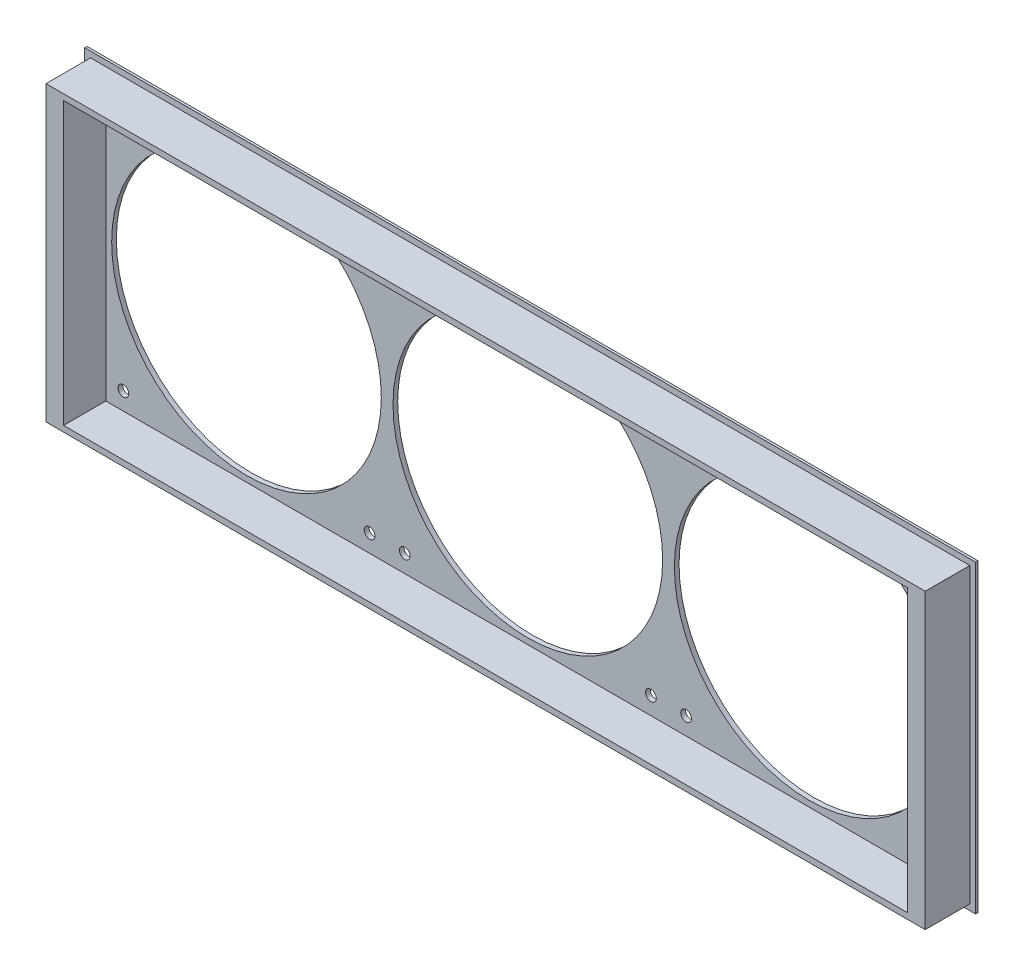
ISO-10303-21;
HEADER;
FILE_DESCRIPTION(('STEP AP214'),'2;1');
FILE_NAME('part.step','',(''),(''),'','','');
FILE_SCHEMA(('AUTOMOTIVE_DESIGN { 1 0 10303 214 1 1 1 1 }'));
ENDSEC;
DATA;
#1=APPLICATION_CONTEXT('core data for automotive mechanical design processes');
#2=APPLICATION_PROTOCOL_DEFINITION('international standard','automotive_design',2000,#1);
#3=PRODUCT_CONTEXT('',#1,'mechanical');
#4=PRODUCT('Part','Part','',(#3));
#5=PRODUCT_RELATED_PRODUCT_CATEGORY('part','',(#4));
#6=PRODUCT_DEFINITION_FORMATION('','',#4);
#7=PRODUCT_DEFINITION_CONTEXT('part definition',#1,'design');
#8=PRODUCT_DEFINITION('design','',#6,#7);
#9=PRODUCT_DEFINITION_SHAPE('','',#8);
#10=(LENGTH_UNIT() NAMED_UNIT(*) SI_UNIT(.MILLI.,.METRE.));
#11=(NAMED_UNIT(*) PLANE_ANGLE_UNIT() SI_UNIT($,.RADIAN.));
#12=(NAMED_UNIT(*) SI_UNIT($,.STERADIAN.) SOLID_ANGLE_UNIT());
#13=UNCERTAINTY_MEASURE_WITH_UNIT(LENGTH_MEASURE(1.E-05),#10,'distance_accuracy_value','');
#14=(GEOMETRIC_REPRESENTATION_CONTEXT(3) GLOBAL_UNCERTAINTY_ASSIGNED_CONTEXT((#13)) GLOBAL_UNIT_ASSIGNED_CONTEXT((#10,
#11,#12)) REPRESENTATION_CONTEXT('',''));
#15=CARTESIAN_POINT('',(0.,0.,0.));
#16=DIRECTION('',(0.,0.,1.));
#17=DIRECTION('',(1.,0.,0.));
#18=AXIS2_PLACEMENT_3D('',#15,#16,#17);
#19=CARTESIAN_POINT('',(-131.094890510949,20.2919708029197,-10.));
#20=DIRECTION('',(0.,0.,1.));
#21=DIRECTION('',(1.,0.,0.));
#22=AXIS2_PLACEMENT_3D('',#19,#20,#21);
#23=CYLINDRICAL_SURFACE('',#22,57.5);
#24=CARTESIAN_POINT('',(-131.094890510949,20.2919708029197,0.));
#25=DIRECTION('',(0.,0.,1.));
#26=DIRECTION('',(1.,0.,0.));
#27=AXIS2_PLACEMENT_3D('',#24,#25,#26);
#28=CIRCLE('',#27,57.5);
#29=CARTESIAN_POINT('',(-73.5948905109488,20.2919708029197,0.));
#30=VERTEX_POINT('',#29);
#31=EDGE_CURVE('E231',#30,#30,#28,.T.);
#32=ORIENTED_EDGE('',*,*,#31,.F.);
#33=EDGE_LOOP('',(#32));
#34=FACE_BOUND('',#33,.T.);
#35=CARTESIAN_POINT('',(-131.094890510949,20.2919708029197,2.));
#36=DIRECTION('',(0.,0.,1.));
#37=DIRECTION('',(1.,0.,0.));
#38=AXIS2_PLACEMENT_3D('',#35,#36,#37);
#39=CIRCLE('',#38,57.5);
#40=CARTESIAN_POINT('',(-73.5948905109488,20.2919708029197,2.));
#41=VERTEX_POINT('',#40);
#42=EDGE_CURVE('E186',#41,#41,#39,.F.);
#43=ORIENTED_EDGE('',*,*,#42,.F.);
#44=EDGE_LOOP('',(#43));
#45=FACE_BOUND('',#44,.T.);
#46=ADVANCED_FACE('F32',(#34,#45),#23,.F.);
#47=CARTESIAN_POINT('',(108.905109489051,20.2919708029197,-10.));
#48=DIRECTION('',(0.,0.,1.));
#49=DIRECTION('',(1.,0.,0.));
#50=AXIS2_PLACEMENT_3D('',#47,#48,#49);
#51=CYLINDRICAL_SURFACE('',#50,57.5);
#52=CARTESIAN_POINT('',(108.905109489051,20.2919708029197,0.));
#53=DIRECTION('',(0.,0.,1.));
#54=DIRECTION('',(1.,0.,0.));
#55=AXIS2_PLACEMENT_3D('',#52,#53,#54);
#56=CIRCLE('',#55,57.5);
#57=CARTESIAN_POINT('',(166.405109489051,20.2919708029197,0.));
#58=VERTEX_POINT('',#57);
#59=EDGE_CURVE('E225',#58,#58,#56,.T.);
#60=ORIENTED_EDGE('',*,*,#59,.F.);
#61=EDGE_LOOP('',(#60));
#62=FACE_BOUND('',#61,.T.);
#63=CARTESIAN_POINT('',(108.905109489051,20.2919708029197,2.));
#64=DIRECTION('',(0.,0.,1.));
#65=DIRECTION('',(1.,0.,0.));
#66=AXIS2_PLACEMENT_3D('',#63,#64,#65);
#67=CIRCLE('',#66,57.5);
#68=CARTESIAN_POINT('',(166.405109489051,20.2919708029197,2.));
#69=VERTEX_POINT('',#68);
#70=EDGE_CURVE('E183',#69,#69,#67,.F.);
#71=ORIENTED_EDGE('',*,*,#70,.F.);
#72=EDGE_LOOP('',(#71));
#73=FACE_BOUND('',#72,.T.);
#74=ADVANCED_FACE('F331',(#62,#73),#51,.F.);
#75=CARTESIAN_POINT('',(-11.0948905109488,20.2919708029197,-10.));
#76=DIRECTION('',(0.,0.,1.));
#77=DIRECTION('',(1.,0.,0.));
#78=AXIS2_PLACEMENT_3D('',#75,#76,#77);
#79=CYLINDRICAL_SURFACE('',#78,57.5);
#80=CARTESIAN_POINT('',(-11.0948905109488,20.2919708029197,0.));
#81=DIRECTION('',(0.,0.,1.));
#82=DIRECTION('',(1.,0.,0.));
#83=AXIS2_PLACEMENT_3D('',#80,#81,#82);
#84=CIRCLE('',#83,57.5);
#85=CARTESIAN_POINT('',(46.4051094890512,20.2919708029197,0.));
#86=VERTEX_POINT('',#85);
#87=EDGE_CURVE('E228',#86,#86,#84,.T.);
#88=ORIENTED_EDGE('',*,*,#87,.F.);
#89=EDGE_LOOP('',(#88));
#90=FACE_BOUND('',#89,.T.);
#91=CARTESIAN_POINT('',(-11.0948905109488,20.2919708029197,2.));
#92=DIRECTION('',(0.,0.,1.));
#93=DIRECTION('',(1.,0.,0.));
#94=AXIS2_PLACEMENT_3D('',#91,#92,#93);
#95=CIRCLE('',#94,57.5);
#96=CARTESIAN_POINT('',(46.4051094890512,20.2919708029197,2.));
#97=VERTEX_POINT('',#96);
#98=EDGE_CURVE('E180',#97,#97,#95,.F.);
#99=ORIENTED_EDGE('',*,*,#98,.F.);
#100=EDGE_LOOP('',(#99));
#101=FACE_BOUND('',#100,.T.);
#102=ADVANCED_FACE('F337',(#90,#101),#79,.F.);
#103=CARTESIAN_POINT('',(-183.59489051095,72.7919708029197,-10.));
#104=DIRECTION('',(0.,0.,1.));
#105=DIRECTION('',(1.,0.,0.));
#106=AXIS2_PLACEMENT_3D('',#103,#104,#105);
#107=CYLINDRICAL_SURFACE('',#106,2.285);
#108=CARTESIAN_POINT('',(-183.59489051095,72.7919708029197,0.));
#109=DIRECTION('',(0.,0.,1.));
#110=DIRECTION('',(1.,0.,0.));
#111=AXIS2_PLACEMENT_3D('',#108,#109,#110);
#112=CIRCLE('',#111,2.285);
#113=CARTESIAN_POINT('',(-181.30989051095,72.7919708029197,0.));
#114=VERTEX_POINT('',#113);
#115=EDGE_CURVE('E222',#114,#114,#112,.T.);
#116=ORIENTED_EDGE('',*,*,#115,.F.);
#117=EDGE_LOOP('',(#116));
#118=FACE_BOUND('',#117,.T.);
#119=CARTESIAN_POINT('',(-183.59489051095,72.7919708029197,2.));
#120=DIRECTION('',(0.,0.,1.));
#121=DIRECTION('',(1.,0.,0.));
#122=AXIS2_PLACEMENT_3D('',#119,#120,#121);
#123=CIRCLE('',#122,2.285);
#124=CARTESIAN_POINT('',(-181.30989051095,72.7919708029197,2.));
#125=VERTEX_POINT('',#124);
#126=EDGE_CURVE('E177',#125,#125,#123,.F.);
#127=ORIENTED_EDGE('',*,*,#126,.F.);
#128=EDGE_LOOP('',(#127));
#129=FACE_BOUND('',#128,.T.);
#130=ADVANCED_FACE('F473',(#118,#129),#107,.F.);
#131=CARTESIAN_POINT('',(41.4051094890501,72.7919708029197,-10.));
#132=DIRECTION('',(0.,0.,1.));
#133=DIRECTION('',(1.,0.,0.));
#134=AXIS2_PLACEMENT_3D('',#131,#132,#133);
#135=CYLINDRICAL_SURFACE('',#134,2.285);
#136=CARTESIAN_POINT('',(41.4051094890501,72.7919708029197,0.));
#137=DIRECTION('',(0.,0.,1.));
#138=DIRECTION('',(1.,0.,0.));
#139=AXIS2_PLACEMENT_3D('',#136,#137,#138);
#140=CIRCLE('',#139,2.285);
#141=CARTESIAN_POINT('',(43.6901094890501,72.7919708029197,0.));
#142=VERTEX_POINT('',#141);
#143=EDGE_CURVE('E189',#142,#142,#140,.T.);
#144=ORIENTED_EDGE('',*,*,#143,.F.);
#145=EDGE_LOOP('',(#144));
#146=FACE_BOUND('',#145,.T.);
#147=CARTESIAN_POINT('',(41.4051094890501,72.7919708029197,2.));
#148=DIRECTION('',(0.,0.,1.));
#149=DIRECTION('',(1.,0.,0.));
#150=AXIS2_PLACEMENT_3D('',#147,#148,#149);
#151=CIRCLE('',#150,2.285);
#152=CARTESIAN_POINT('',(43.6901094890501,72.7919708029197,2.));
#153=VERTEX_POINT('',#152);
#154=EDGE_CURVE('E174',#153,#153,#151,.F.);
#155=ORIENTED_EDGE('',*,*,#154,.F.);
#156=EDGE_LOOP('',(#155));
#157=FACE_BOUND('',#156,.T.);
#158=ADVANCED_FACE('F481',(#146,#157),#135,.F.);
#159=CARTESIAN_POINT('',(-63.5948905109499,72.7919708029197,-10.));
#160=DIRECTION('',(0.,0.,1.));
#161=DIRECTION('',(1.,0.,0.));
#162=AXIS2_PLACEMENT_3D('',#159,#160,#161);
#163=CYLINDRICAL_SURFACE('',#162,2.285);
#164=CARTESIAN_POINT('',(-63.5948905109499,72.7919708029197,0.));
#165=DIRECTION('',(0.,0.,1.));
#166=DIRECTION('',(1.,0.,0.));
#167=AXIS2_PLACEMENT_3D('',#164,#165,#166);
#168=CIRCLE('',#167,2.285);
#169=CARTESIAN_POINT('',(-61.3098905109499,72.7919708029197,0.));
#170=VERTEX_POINT('',#169);
#171=EDGE_CURVE('E192',#170,#170,#168,.T.);
#172=ORIENTED_EDGE('',*,*,#171,.F.);
#173=EDGE_LOOP('',(#172));
#174=FACE_BOUND('',#173,.T.);
#175=CARTESIAN_POINT('',(-63.5948905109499,72.7919708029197,2.));
#176=DIRECTION('',(0.,0.,1.));
#177=DIRECTION('',(1.,0.,0.));
#178=AXIS2_PLACEMENT_3D('',#175,#176,#177);
#179=CIRCLE('',#178,2.285);
#180=CARTESIAN_POINT('',(-61.3098905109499,72.7919708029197,2.));
#181=VERTEX_POINT('',#180);
#182=EDGE_CURVE('E171',#181,#181,#179,.F.);
#183=ORIENTED_EDGE('',*,*,#182,.F.);
#184=EDGE_LOOP('',(#183));
#185=FACE_BOUND('',#184,.T.);
#186=ADVANCED_FACE('F490',(#174,#185),#163,.F.);
#187=CARTESIAN_POINT('',(-183.594890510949,-32.2080291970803,-10.));
#188=DIRECTION('',(0.,0.,1.));
#189=DIRECTION('',(1.,0.,0.));
#190=AXIS2_PLACEMENT_3D('',#187,#188,#189);
#191=CYLINDRICAL_SURFACE('',#190,2.285);
#192=CARTESIAN_POINT('',(-183.594890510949,-32.2080291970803,0.));
#193=DIRECTION('',(0.,0.,1.));
#194=DIRECTION('',(1.,0.,0.));
#195=AXIS2_PLACEMENT_3D('',#192,#193,#194);
#196=CIRCLE('',#195,2.285);
#197=CARTESIAN_POINT('',(-181.309890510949,-32.2080291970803,0.));
#198=VERTEX_POINT('',#197);
#199=EDGE_CURVE('E195',#198,#198,#196,.T.);
#200=ORIENTED_EDGE('',*,*,#199,.F.);
#201=EDGE_LOOP('',(#200));
#202=FACE_BOUND('',#201,.T.);
#203=CARTESIAN_POINT('',(-183.594890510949,-32.2080291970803,2.));
#204=DIRECTION('',(0.,0.,1.));
#205=DIRECTION('',(1.,0.,0.));
#206=AXIS2_PLACEMENT_3D('',#203,#204,#205);
#207=CIRCLE('',#206,2.285);
#208=CARTESIAN_POINT('',(-181.309890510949,-32.2080291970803,2.));
#209=VERTEX_POINT('',#208);
#210=EDGE_CURVE('E168',#209,#209,#207,.F.);
#211=ORIENTED_EDGE('',*,*,#210,.F.);
#212=EDGE_LOOP('',(#211));
#213=FACE_BOUND('',#212,.T.);
#214=ADVANCED_FACE('F499',(#202,#213),#191,.F.);
#215=CARTESIAN_POINT('',(-78.5948905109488,-32.2080291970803,-10.));
#216=DIRECTION('',(0.,0.,1.));
#217=DIRECTION('',(1.,0.,0.));
#218=AXIS2_PLACEMENT_3D('',#215,#216,#217);
#219=CYLINDRICAL_SURFACE('',#218,2.285);
#220=CARTESIAN_POINT('',(-78.5948905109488,-32.2080291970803,0.));
#221=DIRECTION('',(0.,0.,1.));
#222=DIRECTION('',(1.,0.,0.));
#223=AXIS2_PLACEMENT_3D('',#220,#221,#222);
#224=CIRCLE('',#223,2.285);
#225=CARTESIAN_POINT('',(-76.3098905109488,-32.2080291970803,0.));
#226=VERTEX_POINT('',#225);
#227=EDGE_CURVE('E198',#226,#226,#224,.T.);
#228=ORIENTED_EDGE('',*,*,#227,.F.);
#229=EDGE_LOOP('',(#228));
#230=FACE_BOUND('',#229,.T.);
#231=CARTESIAN_POINT('',(-78.5948905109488,-32.2080291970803,2.));
#232=DIRECTION('',(0.,0.,1.));
#233=DIRECTION('',(1.,0.,0.));
#234=AXIS2_PLACEMENT_3D('',#231,#232,#233);
#235=CIRCLE('',#234,2.285);
#236=CARTESIAN_POINT('',(-76.3098905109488,-32.2080291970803,2.));
#237=VERTEX_POINT('',#236);
#238=EDGE_CURVE('E165',#237,#237,#235,.F.);
#239=ORIENTED_EDGE('',*,*,#238,.F.);
#240=EDGE_LOOP('',(#239));
#241=FACE_BOUND('',#240,.T.);
#242=ADVANCED_FACE('F508',(#230,#241),#219,.F.);
#243=CARTESIAN_POINT('',(-78.5948905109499,72.7919708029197,-10.));
#244=DIRECTION('',(0.,0.,1.));
#245=DIRECTION('',(1.,0.,0.));
#246=AXIS2_PLACEMENT_3D('',#243,#244,#245);
#247=CYLINDRICAL_SURFACE('',#246,2.285);
#248=CARTESIAN_POINT('',(-78.5948905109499,72.7919708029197,0.));
#249=DIRECTION('',(0.,0.,1.));
#250=DIRECTION('',(1.,0.,0.));
#251=AXIS2_PLACEMENT_3D('',#248,#249,#250);
#252=CIRCLE('',#251,2.285);
#253=CARTESIAN_POINT('',(-76.3098905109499,72.7919708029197,0.));
#254=VERTEX_POINT('',#253);
#255=EDGE_CURVE('E201',#254,#254,#252,.T.);
#256=ORIENTED_EDGE('',*,*,#255,.F.);
#257=EDGE_LOOP('',(#256));
#258=FACE_BOUND('',#257,.T.);
#259=CARTESIAN_POINT('',(-78.5948905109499,72.7919708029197,2.));
#260=DIRECTION('',(0.,0.,1.));
#261=DIRECTION('',(1.,0.,0.));
#262=AXIS2_PLACEMENT_3D('',#259,#260,#261);
#263=CIRCLE('',#262,2.285);
#264=CARTESIAN_POINT('',(-76.3098905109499,72.7919708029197,2.));
#265=VERTEX_POINT('',#264);
#266=EDGE_CURVE('E162',#265,#265,#263,.F.);
#267=ORIENTED_EDGE('',*,*,#266,.F.);
#268=EDGE_LOOP('',(#267));
#269=FACE_BOUND('',#268,.T.);
#270=ADVANCED_FACE('F517',(#258,#269),#247,.F.);
#271=CARTESIAN_POINT('',(56.4051094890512,-32.2080291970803,-10.));
#272=DIRECTION('',(0.,0.,1.));
#273=DIRECTION('',(1.,0.,0.));
#274=AXIS2_PLACEMENT_3D('',#271,#272,#273);
#275=CYLINDRICAL_SURFACE('',#274,2.285);
#276=CARTESIAN_POINT('',(56.4051094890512,-32.2080291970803,0.));
#277=DIRECTION('',(0.,0.,1.));
#278=DIRECTION('',(1.,0.,0.));
#279=AXIS2_PLACEMENT_3D('',#276,#277,#278);
#280=CIRCLE('',#279,2.285);
#281=CARTESIAN_POINT('',(58.6901094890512,-32.2080291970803,0.));
#282=VERTEX_POINT('',#281);
#283=EDGE_CURVE('E204',#282,#282,#280,.T.);
#284=ORIENTED_EDGE('',*,*,#283,.F.);
#285=EDGE_LOOP('',(#284));
#286=FACE_BOUND('',#285,.T.);
#287=CARTESIAN_POINT('',(56.4051094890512,-32.2080291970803,2.));
#288=DIRECTION('',(0.,0.,1.));
#289=DIRECTION('',(1.,0.,0.));
#290=AXIS2_PLACEMENT_3D('',#287,#288,#289);
#291=CIRCLE('',#290,2.285);
#292=CARTESIAN_POINT('',(58.6901094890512,-32.2080291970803,2.));
#293=VERTEX_POINT('',#292);
#294=EDGE_CURVE('E159',#293,#293,#291,.F.);
#295=ORIENTED_EDGE('',*,*,#294,.F.);
#296=EDGE_LOOP('',(#295));
#297=FACE_BOUND('',#296,.T.);
#298=ADVANCED_FACE('F526',(#286,#297),#275,.F.);
#299=CARTESIAN_POINT('',(161.405109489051,-32.2080291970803,-10.));
#300=DIRECTION('',(0.,0.,1.));
#301=DIRECTION('',(1.,0.,0.));
#302=AXIS2_PLACEMENT_3D('',#299,#300,#301);
#303=CYLINDRICAL_SURFACE('',#302,2.285);
#304=CARTESIAN_POINT('',(161.405109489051,-32.2080291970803,0.));
#305=DIRECTION('',(0.,0.,1.));
#306=DIRECTION('',(1.,0.,0.));
#307=AXIS2_PLACEMENT_3D('',#304,#305,#306);
#308=CIRCLE('',#307,2.285);
#309=CARTESIAN_POINT('',(163.690109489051,-32.2080291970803,0.));
#310=VERTEX_POINT('',#309);
#311=EDGE_CURVE('E207',#310,#310,#308,.T.);
#312=ORIENTED_EDGE('',*,*,#311,.F.);
#313=EDGE_LOOP('',(#312));
#314=FACE_BOUND('',#313,.T.);
#315=CARTESIAN_POINT('',(161.405109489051,-32.2080291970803,2.));
#316=DIRECTION('',(0.,0.,1.));
#317=DIRECTION('',(1.,0.,0.));
#318=AXIS2_PLACEMENT_3D('',#315,#316,#317);
#319=CIRCLE('',#318,2.285);
#320=CARTESIAN_POINT('',(163.690109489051,-32.2080291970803,2.));
#321=VERTEX_POINT('',#320);
#322=EDGE_CURVE('E156',#321,#321,#319,.F.);
#323=ORIENTED_EDGE('',*,*,#322,.F.);
#324=EDGE_LOOP('',(#323));
#325=FACE_BOUND('',#324,.T.);
#326=ADVANCED_FACE('F535',(#314,#325),#303,.F.);
#327=CARTESIAN_POINT('',(161.40510948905,72.7919708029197,-10.));
#328=DIRECTION('',(0.,0.,1.));
#329=DIRECTION('',(1.,0.,0.));
#330=AXIS2_PLACEMENT_3D('',#327,#328,#329);
#331=CYLINDRICAL_SURFACE('',#330,2.285);
#332=CARTESIAN_POINT('',(161.40510948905,72.7919708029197,0.));
#333=DIRECTION('',(0.,0.,1.));
#334=DIRECTION('',(1.,0.,0.));
#335=AXIS2_PLACEMENT_3D('',#332,#333,#334);
#336=CIRCLE('',#335,2.285);
#337=CARTESIAN_POINT('',(163.69010948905,72.7919708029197,0.));
#338=VERTEX_POINT('',#337);
#339=EDGE_CURVE('E210',#338,#338,#336,.T.);
#340=ORIENTED_EDGE('',*,*,#339,.F.);
#341=EDGE_LOOP('',(#340));
#342=FACE_BOUND('',#341,.T.);
#343=CARTESIAN_POINT('',(161.40510948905,72.7919708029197,2.));
#344=DIRECTION('',(0.,0.,1.));
#345=DIRECTION('',(1.,0.,0.));
#346=AXIS2_PLACEMENT_3D('',#343,#344,#345);
#347=CIRCLE('',#346,2.285);
#348=CARTESIAN_POINT('',(163.69010948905,72.7919708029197,2.));
#349=VERTEX_POINT('',#348);
#350=EDGE_CURVE('E153',#349,#349,#347,.F.);
#351=ORIENTED_EDGE('',*,*,#350,.F.);
#352=EDGE_LOOP('',(#351));
#353=FACE_BOUND('',#352,.T.);
#354=ADVANCED_FACE('F544',(#342,#353),#331,.F.);
#355=CARTESIAN_POINT('',(41.4051094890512,-32.2080291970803,-10.));
#356=DIRECTION('',(0.,0.,1.));
#357=DIRECTION('',(1.,0.,0.));
#358=AXIS2_PLACEMENT_3D('',#355,#356,#357);
#359=CYLINDRICAL_SURFACE('',#358,2.285);
#360=CARTESIAN_POINT('',(41.4051094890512,-32.2080291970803,0.));
#361=DIRECTION('',(0.,0.,1.));
#362=DIRECTION('',(1.,0.,0.));
#363=AXIS2_PLACEMENT_3D('',#360,#361,#362);
#364=CIRCLE('',#363,2.285);
#365=CARTESIAN_POINT('',(43.6901094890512,-32.2080291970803,0.));
#366=VERTEX_POINT('',#365);
#367=EDGE_CURVE('E213',#366,#366,#364,.T.);
#368=ORIENTED_EDGE('',*,*,#367,.F.);
#369=EDGE_LOOP('',(#368));
#370=FACE_BOUND('',#369,.T.);
#371=CARTESIAN_POINT('',(41.4051094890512,-32.2080291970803,2.));
#372=DIRECTION('',(0.,0.,1.));
#373=DIRECTION('',(1.,0.,0.));
#374=AXIS2_PLACEMENT_3D('',#371,#372,#373);
#375=CIRCLE('',#374,2.285);
#376=CARTESIAN_POINT('',(43.6901094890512,-32.2080291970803,2.));
#377=VERTEX_POINT('',#376);
#378=EDGE_CURVE('E150',#377,#377,#375,.F.);
#379=ORIENTED_EDGE('',*,*,#378,.F.);
#380=EDGE_LOOP('',(#379));
#381=FACE_BOUND('',#380,.T.);
#382=ADVANCED_FACE('F553',(#370,#381),#359,.F.);
#383=CARTESIAN_POINT('',(-63.5948905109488,-32.2080291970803,-10.));
#384=DIRECTION('',(0.,0.,1.));
#385=DIRECTION('',(1.,0.,0.));
#386=AXIS2_PLACEMENT_3D('',#383,#384,#385);
#387=CYLINDRICAL_SURFACE('',#386,2.285);
#388=CARTESIAN_POINT('',(-63.5948905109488,-32.2080291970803,0.));
#389=DIRECTION('',(0.,0.,1.));
#390=DIRECTION('',(1.,0.,0.));
#391=AXIS2_PLACEMENT_3D('',#388,#389,#390);
#392=CIRCLE('',#391,2.285);
#393=CARTESIAN_POINT('',(-61.3098905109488,-32.2080291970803,0.));
#394=VERTEX_POINT('',#393);
#395=EDGE_CURVE('E216',#394,#394,#392,.T.);
#396=ORIENTED_EDGE('',*,*,#395,.F.);
#397=EDGE_LOOP('',(#396));
#398=FACE_BOUND('',#397,.T.);
#399=CARTESIAN_POINT('',(-63.5948905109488,-32.2080291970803,2.));
#400=DIRECTION('',(0.,0.,1.));
#401=DIRECTION('',(1.,0.,0.));
#402=AXIS2_PLACEMENT_3D('',#399,#400,#401);
#403=CIRCLE('',#402,2.285);
#404=CARTESIAN_POINT('',(-61.3098905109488,-32.2080291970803,2.));
#405=VERTEX_POINT('',#404);
#406=EDGE_CURVE('E147',#405,#405,#403,.F.);
#407=ORIENTED_EDGE('',*,*,#406,.F.);
#408=EDGE_LOOP('',(#407));
#409=FACE_BOUND('',#408,.T.);
#410=ADVANCED_FACE('F562',(#398,#409),#387,.F.);
#411=CARTESIAN_POINT('',(56.4051094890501,72.7919708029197,-10.));
#412=DIRECTION('',(0.,0.,1.));
#413=DIRECTION('',(1.,0.,0.));
#414=AXIS2_PLACEMENT_3D('',#411,#412,#413);
#415=CYLINDRICAL_SURFACE('',#414,2.285);
#416=CARTESIAN_POINT('',(56.4051094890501,72.7919708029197,0.));
#417=DIRECTION('',(0.,0.,1.));
#418=DIRECTION('',(1.,0.,0.));
#419=AXIS2_PLACEMENT_3D('',#416,#417,#418);
#420=CIRCLE('',#419,2.285);
#421=CARTESIAN_POINT('',(58.6901094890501,72.7919708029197,0.));
#422=VERTEX_POINT('',#421);
#423=EDGE_CURVE('E219',#422,#422,#420,.T.);
#424=ORIENTED_EDGE('',*,*,#423,.F.);
#425=EDGE_LOOP('',(#424));
#426=FACE_BOUND('',#425,.T.);
#427=CARTESIAN_POINT('',(56.4051094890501,72.7919708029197,2.));
#428=DIRECTION('',(0.,0.,1.));
#429=DIRECTION('',(1.,0.,0.));
#430=AXIS2_PLACEMENT_3D('',#427,#428,#429);
#431=CIRCLE('',#430,2.285);
#432=CARTESIAN_POINT('',(58.6901094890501,72.7919708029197,2.));
#433=VERTEX_POINT('',#432);
#434=EDGE_CURVE('E36',#433,#433,#431,.F.);
#435=ORIENTED_EDGE('',*,*,#434,.F.);
#436=EDGE_LOOP('',(#435));
#437=FACE_BOUND('',#436,.T.);
#438=ADVANCED_FACE('F372',(#426,#437),#415,.F.);
#439=CARTESIAN_POINT('',(0.,0.,20.));
#440=DIRECTION('',(0.,0.,1.));
#441=DIRECTION('',(1.,0.,0.));
#442=AXIS2_PLACEMENT_3D('',#439,#440,#441);
#443=PLANE('',#442);
#444=DIRECTION('',(0.,-1.,0.));
#445=VECTOR('',#444,1.);
#446=CARTESIAN_POINT('',(-191.094890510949,80.2919708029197,20.));
#447=LINE('',#446,#445);
#448=CARTESIAN_POINT('',(-191.094890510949,80.2919708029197,20.));
#449=VERTEX_POINT('',#448);
#450=CARTESIAN_POINT('',(-191.094890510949,-39.7080291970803,20.));
#451=VERTEX_POINT('',#450);
#452=EDGE_CURVE('E48',#449,#451,#447,.T.);
#453=ORIENTED_EDGE('',*,*,#452,.F.);
#454=DIRECTION('',(-1.,0.,0.));
#455=VECTOR('',#454,1.);
#456=CARTESIAN_POINT('',(-191.094890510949,80.2919708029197,20.));
#457=LINE('',#456,#455);
#458=CARTESIAN_POINT('',(168.905109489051,80.2919708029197,20.));
#459=VERTEX_POINT('',#458);
#460=EDGE_CURVE('E129',#459,#449,#457,.T.);
#461=ORIENTED_EDGE('',*,*,#460,.F.);
#462=DIRECTION('',(0.,1.,0.));
#463=VECTOR('',#462,1.);
#464=CARTESIAN_POINT('',(168.905109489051,80.2919708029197,20.));
#465=LINE('',#464,#463);
#466=CARTESIAN_POINT('',(168.905109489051,-39.7080291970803,20.));
#467=VERTEX_POINT('',#466);
#468=EDGE_CURVE('E237',#467,#459,#465,.T.);
#469=ORIENTED_EDGE('',*,*,#468,.F.);
#470=DIRECTION('',(1.,0.,0.));
#471=VECTOR('',#470,1.);
#472=CARTESIAN_POINT('',(-191.094890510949,-39.7080291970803,20.));
#473=LINE('',#472,#471);
#474=EDGE_CURVE('E235',#451,#467,#473,.T.);
#475=ORIENTED_EDGE('',*,*,#474,.F.);
#476=EDGE_LOOP('',(#453,#461,#469,#475));
#477=FACE_BOUND('',#476,.T.);
#478=DIRECTION('',(-1.,0.,0.));
#479=VECTOR('',#478,1.);
#480=CARTESIAN_POINT('',(176.405109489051,-42.2080291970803,20.));
#481=LINE('',#480,#479);
#482=CARTESIAN_POINT('',(176.405109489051,-42.2080291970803,20.));
#483=VERTEX_POINT('',#482);
#484=CARTESIAN_POINT('',(-198.594890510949,-42.2080291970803,20.));
#485=VERTEX_POINT('',#484);
#486=EDGE_CURVE('E56',#483,#485,#481,.T.);
#487=ORIENTED_EDGE('',*,*,#486,.F.);
#488=DIRECTION('',(0.,-1.,0.));
#489=VECTOR('',#488,1.);
#490=CARTESIAN_POINT('',(176.405109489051,82.7919708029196,20.));
#491=LINE('',#490,#489);
#492=CARTESIAN_POINT('',(176.405109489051,82.7919708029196,20.));
#493=VERTEX_POINT('',#492);
#494=EDGE_CURVE('E261',#493,#483,#491,.T.);
#495=ORIENTED_EDGE('',*,*,#494,.F.);
#496=DIRECTION('',(1.,0.,0.));
#497=VECTOR('',#496,1.);
#498=CARTESIAN_POINT('',(178.905109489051,82.7919708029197,20.));
#499=LINE('',#498,#497);
#500=CARTESIAN_POINT('',(-198.594890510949,82.7919708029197,20.));
#501=VERTEX_POINT('',#500);
#502=EDGE_CURVE('E276',#501,#493,#499,.T.);
#503=ORIENTED_EDGE('',*,*,#502,.F.);
#504=DIRECTION('',(0.,1.,0.));
#505=VECTOR('',#504,1.);
#506=CARTESIAN_POINT('',(-198.594890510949,82.7919708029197,20.));
#507=LINE('',#506,#505);
#508=EDGE_CURVE('E254',#485,#501,#507,.T.);
#509=ORIENTED_EDGE('',*,*,#508,.F.);
#510=EDGE_LOOP('',(#487,#495,#503,#509));
#511=FACE_BOUND('',#510,.T.);
#512=ADVANCED_FACE('F327',(#477,#511),#443,.T.);
#513=CARTESIAN_POINT('',(0.,82.7919708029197,0.));
#514=DIRECTION('',(0.,-1.,0.));
#515=DIRECTION('',(0.,0.,-1.));
#516=AXIS2_PLACEMENT_3D('',#513,#514,#515);
#517=PLANE('',#516);
#518=DIRECTION('',(-1.,0.,0.));
#519=VECTOR('',#518,1.);
#520=CARTESIAN_POINT('',(178.905109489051,82.7919708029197,1.));
#521=LINE('',#520,#519);
#522=CARTESIAN_POINT('',(176.405109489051,82.7919708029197,1.));
#523=VERTEX_POINT('',#522);
#524=CARTESIAN_POINT('',(-198.594890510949,82.7919708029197,1.00000000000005));
#525=VERTEX_POINT('',#524);
#526=EDGE_CURVE('E273',#523,#525,#521,.T.);
#527=ORIENTED_EDGE('',*,*,#526,.T.);
#528=DIRECTION('',(0.,0.,-1.));
#529=VECTOR('',#528,1.);
#530=CARTESIAN_POINT('',(-198.594890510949,82.7919708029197,20.));
#531=LINE('',#530,#529);
#532=EDGE_CURVE('E256',#501,#525,#531,.T.);
#533=ORIENTED_EDGE('',*,*,#532,.F.);
#534=ORIENTED_EDGE('',*,*,#502,.T.);
#535=DIRECTION('',(0.,0.,1.));
#536=VECTOR('',#535,1.);
#537=CARTESIAN_POINT('',(176.405109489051,82.7919708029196,20.));
#538=LINE('',#537,#536);
#539=EDGE_CURVE('E266',#523,#493,#538,.T.);
#540=ORIENTED_EDGE('',*,*,#539,.F.);
#541=EDGE_LOOP('',(#527,#533,#534,#540));
#542=FACE_BOUND('',#541,.T.);
#543=ADVANCED_FACE('F322',(#542),#517,.F.);
#544=CARTESIAN_POINT('',(-201.094890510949,85.2919708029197,20.));
#545=DIRECTION('',(1.,0.,0.));
#546=DIRECTION('',(0.,1.,0.));
#547=AXIS2_PLACEMENT_3D('',#544,#545,#546);
#548=PLANE('',#547);
#549=DIRECTION('',(0.,0.,-1.));
#550=VECTOR('',#549,1.);
#551=CARTESIAN_POINT('',(-201.094890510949,-44.7080291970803,20.));
#552=LINE('',#551,#550);
#553=CARTESIAN_POINT('',(-201.094890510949,-44.7080291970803,1.00000000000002));
#554=VERTEX_POINT('',#553);
#555=CARTESIAN_POINT('',(-201.094890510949,-44.7080291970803,0.));
#556=VERTEX_POINT('',#555);
#557=EDGE_CURVE('E11',#554,#556,#552,.T.);
#558=ORIENTED_EDGE('',*,*,#557,.F.);
#559=DIRECTION('',(0.,1.,0.));
#560=VECTOR('',#559,1.);
#561=CARTESIAN_POINT('',(-201.094890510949,82.7919708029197,1.00000000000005));
#562=LINE('',#561,#560);
#563=CARTESIAN_POINT('',(-201.094890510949,85.2919708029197,1.00000000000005));
#564=VERTEX_POINT('',#563);
#565=EDGE_CURVE('E280',#554,#564,#562,.T.);
#566=ORIENTED_EDGE('',*,*,#565,.T.);
#567=DIRECTION('',(0.,0.,-1.));
#568=VECTOR('',#567,1.);
#569=CARTESIAN_POINT('',(-201.094890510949,85.2919708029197,20.));
#570=LINE('',#569,#568);
#571=CARTESIAN_POINT('',(-201.094890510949,85.2919708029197,0.));
#572=VERTEX_POINT('',#571);
#573=EDGE_CURVE('E296',#564,#572,#570,.T.);
#574=ORIENTED_EDGE('',*,*,#573,.T.);
#575=DIRECTION('',(0.,-1.,0.));
#576=VECTOR('',#575,1.);
#577=CARTESIAN_POINT('',(-201.094890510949,85.2919708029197,0.));
#578=LINE('',#577,#576);
#579=EDGE_CURVE('E283',#572,#556,#578,.T.);
#580=ORIENTED_EDGE('',*,*,#579,.T.);
#581=EDGE_LOOP('',(#558,#566,#574,#580));
#582=FACE_BOUND('',#581,.T.);
#583=ADVANCED_FACE('F34',(#582),#548,.F.);
#584=CARTESIAN_POINT('',(-201.094890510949,-44.7080291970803,20.));
#585=DIRECTION('',(0.,1.,0.));
#586=DIRECTION('',(0.,0.,1.));
#587=AXIS2_PLACEMENT_3D('',#584,#585,#586);
#588=PLANE('',#587);
#589=DIRECTION('',(1.,0.,0.));
#590=VECTOR('',#589,1.);
#591=CARTESIAN_POINT('',(176.405109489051,-44.7080291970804,0.999999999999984));
#592=LINE('',#591,#590);
#593=CARTESIAN_POINT('',(178.905109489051,-44.7080291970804,0.999999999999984));
#594=VERTEX_POINT('',#593);
#595=EDGE_CURVE('E269',#554,#594,#592,.T.);
#596=ORIENTED_EDGE('',*,*,#595,.F.);
#597=ORIENTED_EDGE('',*,*,#557,.T.);
#598=DIRECTION('',(1.,0.,0.));
#599=VECTOR('',#598,1.);
#600=CARTESIAN_POINT('',(-201.094890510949,-44.7080291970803,0.));
#601=LINE('',#600,#599);
#602=CARTESIAN_POINT('',(178.905109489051,-44.7080291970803,0.));
#603=VERTEX_POINT('',#602);
#604=EDGE_CURVE('E287',#556,#603,#601,.T.);
#605=ORIENTED_EDGE('',*,*,#604,.T.);
#606=DIRECTION('',(0.,0.,-1.));
#607=VECTOR('',#606,1.);
#608=CARTESIAN_POINT('',(178.905109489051,-44.7080291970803,20.));
#609=LINE('',#608,#607);
#610=EDGE_CURVE('E41',#594,#603,#609,.T.);
#611=ORIENTED_EDGE('',*,*,#610,.F.);
#612=EDGE_LOOP('',(#596,#597,#605,#611));
#613=FACE_BOUND('',#612,.T.);
#614=ADVANCED_FACE('F308',(#613),#588,.F.);
#615=CARTESIAN_POINT('',(178.905109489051,85.2919708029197,20.));
#616=DIRECTION('',(-1.,0.,0.));
#617=DIRECTION('',(0.,-1.,0.));
#618=AXIS2_PLACEMENT_3D('',#615,#616,#617);
#619=PLANE('',#618);
#620=DIRECTION('',(0.,1.,0.));
#621=VECTOR('',#620,1.);
#622=CARTESIAN_POINT('',(178.905109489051,82.7919708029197,1.));
#623=LINE('',#622,#621);
#624=CARTESIAN_POINT('',(178.905109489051,85.2919708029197,1.));
#625=VERTEX_POINT('',#624);
#626=EDGE_CURVE('E278',#594,#625,#623,.T.);
#627=ORIENTED_EDGE('',*,*,#626,.F.);
#628=ORIENTED_EDGE('',*,*,#610,.T.);
#629=DIRECTION('',(0.,1.,0.));
#630=VECTOR('',#629,1.);
#631=CARTESIAN_POINT('',(178.905109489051,85.2919708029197,0.));
#632=LINE('',#631,#630);
#633=CARTESIAN_POINT('',(178.905109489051,85.2919708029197,0.));
#634=VERTEX_POINT('',#633);
#635=EDGE_CURVE('E290',#603,#634,#632,.T.);
#636=ORIENTED_EDGE('',*,*,#635,.T.);
#637=DIRECTION('',(0.,0.,-1.));
#638=VECTOR('',#637,1.);
#639=CARTESIAN_POINT('',(178.905109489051,85.2919708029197,20.));
#640=LINE('',#639,#638);
#641=EDGE_CURVE('E298',#625,#634,#640,.T.);
#642=ORIENTED_EDGE('',*,*,#641,.F.);
#643=EDGE_LOOP('',(#627,#628,#636,#642));
#644=FACE_BOUND('',#643,.T.);
#645=ADVANCED_FACE('F302',(#644),#619,.F.);
#646=CARTESIAN_POINT('',(-201.094890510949,85.2919708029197,20.));
#647=DIRECTION('',(0.,-1.,0.));
#648=DIRECTION('',(0.,0.,-1.));
#649=AXIS2_PLACEMENT_3D('',#646,#647,#648);
#650=PLANE('',#649);
#651=ORIENTED_EDGE('',*,*,#573,.F.);
#652=DIRECTION('',(-1.,0.,0.));
#653=VECTOR('',#652,1.);
#654=CARTESIAN_POINT('',(178.905109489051,85.2919708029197,1.));
#655=LINE('',#654,#653);
#656=EDGE_CURVE('E272',#625,#564,#655,.T.);
#657=ORIENTED_EDGE('',*,*,#656,.F.);
#658=ORIENTED_EDGE('',*,*,#641,.T.);
#659=DIRECTION('',(-1.,0.,0.));
#660=VECTOR('',#659,1.);
#661=CARTESIAN_POINT('',(-201.094890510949,85.2919708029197,0.));
#662=LINE('',#661,#660);
#663=EDGE_CURVE('E293',#634,#572,#662,.T.);
#664=ORIENTED_EDGE('',*,*,#663,.T.);
#665=EDGE_LOOP('',(#651,#657,#658,#664));
#666=FACE_BOUND('',#665,.T.);
#667=ADVANCED_FACE('F315',(#666),#650,.F.);
#668=CARTESIAN_POINT('',(0.,0.,0.));
#669=DIRECTION('',(0.,0.,1.));
#670=DIRECTION('',(1.,0.,0.));
#671=AXIS2_PLACEMENT_3D('',#668,#669,#670);
#672=PLANE('',#671);
#673=ORIENTED_EDGE('',*,*,#423,.T.);
#674=EDGE_LOOP('',(#673));
#675=FACE_BOUND('',#674,.T.);
#676=ORIENTED_EDGE('',*,*,#395,.T.);
#677=EDGE_LOOP('',(#676));
#678=FACE_BOUND('',#677,.T.);
#679=ORIENTED_EDGE('',*,*,#367,.T.);
#680=EDGE_LOOP('',(#679));
#681=FACE_BOUND('',#680,.T.);
#682=ORIENTED_EDGE('',*,*,#339,.T.);
#683=EDGE_LOOP('',(#682));
#684=FACE_BOUND('',#683,.T.);
#685=ORIENTED_EDGE('',*,*,#311,.T.);
#686=EDGE_LOOP('',(#685));
#687=FACE_BOUND('',#686,.T.);
#688=ORIENTED_EDGE('',*,*,#283,.T.);
#689=EDGE_LOOP('',(#688));
#690=FACE_BOUND('',#689,.T.);
#691=ORIENTED_EDGE('',*,*,#255,.T.);
#692=EDGE_LOOP('',(#691));
#693=FACE_BOUND('',#692,.T.);
#694=ORIENTED_EDGE('',*,*,#227,.T.);
#695=EDGE_LOOP('',(#694));
#696=FACE_BOUND('',#695,.T.);
#697=ORIENTED_EDGE('',*,*,#199,.T.);
#698=EDGE_LOOP('',(#697));
#699=FACE_BOUND('',#698,.T.);
#700=ORIENTED_EDGE('',*,*,#171,.T.);
#701=EDGE_LOOP('',(#700));
#702=FACE_BOUND('',#701,.T.);
#703=ORIENTED_EDGE('',*,*,#143,.T.);
#704=EDGE_LOOP('',(#703));
#705=FACE_BOUND('',#704,.T.);
#706=ORIENTED_EDGE('',*,*,#115,.T.);
#707=EDGE_LOOP('',(#706));
#708=FACE_BOUND('',#707,.T.);
#709=ORIENTED_EDGE('',*,*,#87,.T.);
#710=EDGE_LOOP('',(#709));
#711=FACE_BOUND('',#710,.T.);
#712=ORIENTED_EDGE('',*,*,#59,.T.);
#713=EDGE_LOOP('',(#712));
#714=FACE_BOUND('',#713,.T.);
#715=ORIENTED_EDGE('',*,*,#31,.T.);
#716=EDGE_LOOP('',(#715));
#717=FACE_BOUND('',#716,.T.);
#718=ORIENTED_EDGE('',*,*,#579,.F.);
#719=ORIENTED_EDGE('',*,*,#663,.F.);
#720=ORIENTED_EDGE('',*,*,#635,.F.);
#721=ORIENTED_EDGE('',*,*,#604,.F.);
#722=EDGE_LOOP('',(#718,#719,#720,#721));
#723=FACE_BOUND('',#722,.T.);
#724=ADVANCED_FACE('F312',(#675,#678,#681,#684,#687,#690,#693,#696,#699,#702,#705,#708,#711,
#714,#717,#723),#672,.F.);
#725=CARTESIAN_POINT('',(178.905109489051,82.7919708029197,1.));
#726=DIRECTION('',(0.,0.,-1.));
#727=DIRECTION('',(-1.,0.,0.));
#728=AXIS2_PLACEMENT_3D('',#725,#726,#727);
#729=PLANE('',#728);
#730=DIRECTION('',(0.,1.,0.));
#731=VECTOR('',#730,1.);
#732=CARTESIAN_POINT('',(176.405109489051,82.7919708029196,1.));
#733=LINE('',#732,#731);
#734=CARTESIAN_POINT('',(176.405109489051,-42.2080291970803,1.));
#735=VERTEX_POINT('',#734);
#736=EDGE_CURVE('E264',#735,#523,#733,.T.);
#737=ORIENTED_EDGE('',*,*,#736,.F.);
#738=DIRECTION('',(1.,0.,0.));
#739=VECTOR('',#738,1.);
#740=CARTESIAN_POINT('',(176.405109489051,-42.2080291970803,1.));
#741=LINE('',#740,#739);
#742=CARTESIAN_POINT('',(-198.594890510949,-42.2080291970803,0.999999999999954));
#743=VERTEX_POINT('',#742);
#744=EDGE_CURVE('E252',#743,#735,#741,.T.);
#745=ORIENTED_EDGE('',*,*,#744,.F.);
#746=DIRECTION('',(0.,-1.,0.));
#747=VECTOR('',#746,1.);
#748=CARTESIAN_POINT('',(-198.594890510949,82.7919708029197,1.));
#749=LINE('',#748,#747);
#750=EDGE_CURVE('E258',#525,#743,#749,.T.);
#751=ORIENTED_EDGE('',*,*,#750,.F.);
#752=ORIENTED_EDGE('',*,*,#526,.F.);
#753=EDGE_LOOP('',(#737,#745,#751,#752));
#754=FACE_BOUND('',#753,.T.);
#755=ORIENTED_EDGE('',*,*,#656,.T.);
#756=ORIENTED_EDGE('',*,*,#565,.F.);
#757=ORIENTED_EDGE('',*,*,#595,.T.);
#758=ORIENTED_EDGE('',*,*,#626,.T.);
#759=EDGE_LOOP('',(#755,#756,#757,#758));
#760=FACE_BOUND('',#759,.T.);
#761=ADVANCED_FACE('F319',(#754,#760),#729,.F.);
#762=CARTESIAN_POINT('',(176.405109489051,0.,0.));
#763=DIRECTION('',(1.,0.,0.));
#764=DIRECTION('',(0.,1.,0.));
#765=AXIS2_PLACEMENT_3D('',#762,#763,#764);
#766=PLANE('',#765);
#767=DIRECTION('',(0.,0.,1.));
#768=VECTOR('',#767,1.);
#769=CARTESIAN_POINT('',(176.405109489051,-42.2080291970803,20.));
#770=LINE('',#769,#768);
#771=EDGE_CURVE('E244',#735,#483,#770,.T.);
#772=ORIENTED_EDGE('',*,*,#771,.F.);
#773=ORIENTED_EDGE('',*,*,#736,.T.);
#774=ORIENTED_EDGE('',*,*,#539,.T.);
#775=ORIENTED_EDGE('',*,*,#494,.T.);
#776=EDGE_LOOP('',(#772,#773,#774,#775));
#777=FACE_BOUND('',#776,.T.);
#778=ADVANCED_FACE('F362',(#777),#766,.T.);
#779=CARTESIAN_POINT('',(-198.594890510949,0.,0.));
#780=DIRECTION('',(1.,0.,0.));
#781=DIRECTION('',(0.,1.,0.));
#782=AXIS2_PLACEMENT_3D('',#779,#780,#781);
#783=PLANE('',#782);
#784=ORIENTED_EDGE('',*,*,#750,.T.);
#785=DIRECTION('',(0.,0.,-1.));
#786=VECTOR('',#785,1.);
#787=CARTESIAN_POINT('',(-198.594890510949,-42.2080291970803,20.));
#788=LINE('',#787,#786);
#789=EDGE_CURVE('E250',#485,#743,#788,.T.);
#790=ORIENTED_EDGE('',*,*,#789,.F.);
#791=ORIENTED_EDGE('',*,*,#508,.T.);
#792=ORIENTED_EDGE('',*,*,#532,.T.);
#793=EDGE_LOOP('',(#784,#790,#791,#792));
#794=FACE_BOUND('',#793,.T.);
#795=ADVANCED_FACE('F359',(#794),#783,.F.);
#796=CARTESIAN_POINT('',(0.,-42.2080291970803,0.));
#797=DIRECTION('',(0.,1.,0.));
#798=DIRECTION('',(0.,0.,1.));
#799=AXIS2_PLACEMENT_3D('',#796,#797,#798);
#800=PLANE('',#799);
#801=ORIENTED_EDGE('',*,*,#771,.T.);
#802=ORIENTED_EDGE('',*,*,#486,.T.);
#803=ORIENTED_EDGE('',*,*,#789,.T.);
#804=ORIENTED_EDGE('',*,*,#744,.T.);
#805=EDGE_LOOP('',(#801,#802,#803,#804));
#806=FACE_BOUND('',#805,.T.);
#807=ADVANCED_FACE('F356',(#806),#800,.F.);
#808=CARTESIAN_POINT('',(-191.094890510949,80.2919708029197,5.));
#809=DIRECTION('',(-1.,0.,0.));
#810=DIRECTION('',(0.,0.,1.));
#811=AXIS2_PLACEMENT_3D('',#808,#809,#810);
#812=PLANE('',#811);
#813=ORIENTED_EDGE('',*,*,#452,.T.);
#814=DIRECTION('',(0.,0.,1.));
#815=VECTOR('',#814,1.);
#816=CARTESIAN_POINT('',(-191.094890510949,-39.7080291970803,5.));
#817=LINE('',#816,#815);
#818=CARTESIAN_POINT('',(-191.094890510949,-39.7080291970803,2.));
#819=VERTEX_POINT('',#818);
#820=EDGE_CURVE('E119',#819,#451,#817,.T.);
#821=ORIENTED_EDGE('',*,*,#820,.F.);
#822=DIRECTION('',(0.,-1.,0.));
#823=VECTOR('',#822,1.);
#824=CARTESIAN_POINT('',(-191.094890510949,80.2919708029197,2.));
#825=LINE('',#824,#823);
#826=CARTESIAN_POINT('',(-191.094890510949,80.2919708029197,2.));
#827=VERTEX_POINT('',#826);
#828=EDGE_CURVE('E123',#827,#819,#825,.T.);
#829=ORIENTED_EDGE('',*,*,#828,.F.);
#830=DIRECTION('',(0.,0.,1.));
#831=VECTOR('',#830,1.);
#832=CARTESIAN_POINT('',(-191.094890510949,80.2919708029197,5.));
#833=LINE('',#832,#831);
#834=EDGE_CURVE('E242',#827,#449,#833,.T.);
#835=ORIENTED_EDGE('',*,*,#834,.T.);
#836=EDGE_LOOP('',(#813,#821,#829,#835));
#837=FACE_BOUND('',#836,.T.);
#838=ADVANCED_FACE('F121',(#837),#812,.F.);
#839=CARTESIAN_POINT('',(-191.094890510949,80.2919708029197,5.));
#840=DIRECTION('',(0.,1.,0.));
#841=DIRECTION('',(0.,0.,1.));
#842=AXIS2_PLACEMENT_3D('',#839,#840,#841);
#843=PLANE('',#842);
#844=ORIENTED_EDGE('',*,*,#460,.T.);
#845=ORIENTED_EDGE('',*,*,#834,.F.);
#846=DIRECTION('',(-1.,0.,0.));
#847=VECTOR('',#846,1.);
#848=CARTESIAN_POINT('',(-191.094890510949,80.2919708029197,2.));
#849=LINE('',#848,#847);
#850=CARTESIAN_POINT('',(168.905109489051,80.2919708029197,2.));
#851=VERTEX_POINT('',#850);
#852=EDGE_CURVE('E142',#851,#827,#849,.T.);
#853=ORIENTED_EDGE('',*,*,#852,.F.);
#854=DIRECTION('',(0.,0.,1.));
#855=VECTOR('',#854,1.);
#856=CARTESIAN_POINT('',(168.905109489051,80.2919708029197,5.));
#857=LINE('',#856,#855);
#858=EDGE_CURVE('E245',#851,#459,#857,.T.);
#859=ORIENTED_EDGE('',*,*,#858,.T.);
#860=EDGE_LOOP('',(#844,#845,#853,#859));
#861=FACE_BOUND('',#860,.T.);
#862=ADVANCED_FACE('F344',(#861),#843,.F.);
#863=CARTESIAN_POINT('',(168.905109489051,80.2919708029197,5.));
#864=DIRECTION('',(1.,0.,0.));
#865=DIRECTION('',(0.,1.,0.));
#866=AXIS2_PLACEMENT_3D('',#863,#864,#865);
#867=PLANE('',#866);
#868=ORIENTED_EDGE('',*,*,#468,.T.);
#869=ORIENTED_EDGE('',*,*,#858,.F.);
#870=DIRECTION('',(0.,1.,0.));
#871=VECTOR('',#870,1.);
#872=CARTESIAN_POINT('',(168.905109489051,80.2919708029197,2.));
#873=LINE('',#872,#871);
#874=CARTESIAN_POINT('',(168.905109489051,-39.7080291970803,2.));
#875=VERTEX_POINT('',#874);
#876=EDGE_CURVE('E137',#875,#851,#873,.T.);
#877=ORIENTED_EDGE('',*,*,#876,.F.);
#878=DIRECTION('',(0.,0.,1.));
#879=VECTOR('',#878,1.);
#880=CARTESIAN_POINT('',(168.905109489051,-39.7080291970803,5.));
#881=LINE('',#880,#879);
#882=EDGE_CURVE('E128',#875,#467,#881,.T.);
#883=ORIENTED_EDGE('',*,*,#882,.T.);
#884=EDGE_LOOP('',(#868,#869,#877,#883));
#885=FACE_BOUND('',#884,.T.);
#886=ADVANCED_FACE('F347',(#885),#867,.F.);
#887=CARTESIAN_POINT('',(-191.094890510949,-39.7080291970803,5.));
#888=DIRECTION('',(0.,-1.,0.));
#889=DIRECTION('',(0.,0.,-1.));
#890=AXIS2_PLACEMENT_3D('',#887,#888,#889);
#891=PLANE('',#890);
#892=ORIENTED_EDGE('',*,*,#474,.T.);
#893=ORIENTED_EDGE('',*,*,#882,.F.);
#894=DIRECTION('',(1.,0.,0.));
#895=VECTOR('',#894,1.);
#896=CARTESIAN_POINT('',(-191.094890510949,-39.7080291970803,2.));
#897=LINE('',#896,#895);
#898=EDGE_CURVE('E132',#819,#875,#897,.T.);
#899=ORIENTED_EDGE('',*,*,#898,.F.);
#900=ORIENTED_EDGE('',*,*,#820,.T.);
#901=EDGE_LOOP('',(#892,#893,#899,#900));
#902=FACE_BOUND('',#901,.T.);
#903=ADVANCED_FACE('F133',(#902),#891,.F.);
#904=CARTESIAN_POINT('',(0.,0.,2.));
#905=DIRECTION('',(0.,0.,1.));
#906=DIRECTION('',(1.,0.,0.));
#907=AXIS2_PLACEMENT_3D('',#904,#905,#906);
#908=PLANE('',#907);
#909=ORIENTED_EDGE('',*,*,#828,.T.);
#910=ORIENTED_EDGE('',*,*,#898,.T.);
#911=ORIENTED_EDGE('',*,*,#876,.T.);
#912=ORIENTED_EDGE('',*,*,#852,.T.);
#913=EDGE_LOOP('',(#909,#910,#911,#912));
#914=FACE_BOUND('',#913,.T.);
#915=ORIENTED_EDGE('',*,*,#434,.T.);
#916=EDGE_LOOP('',(#915));
#917=FACE_BOUND('',#916,.T.);
#918=ORIENTED_EDGE('',*,*,#406,.T.);
#919=EDGE_LOOP('',(#918));
#920=FACE_BOUND('',#919,.T.);
#921=ORIENTED_EDGE('',*,*,#378,.T.);
#922=EDGE_LOOP('',(#921));
#923=FACE_BOUND('',#922,.T.);
#924=ORIENTED_EDGE('',*,*,#350,.T.);
#925=EDGE_LOOP('',(#924));
#926=FACE_BOUND('',#925,.T.);
#927=ORIENTED_EDGE('',*,*,#322,.T.);
#928=EDGE_LOOP('',(#927));
#929=FACE_BOUND('',#928,.T.);
#930=ORIENTED_EDGE('',*,*,#294,.T.);
#931=EDGE_LOOP('',(#930));
#932=FACE_BOUND('',#931,.T.);
#933=ORIENTED_EDGE('',*,*,#266,.T.);
#934=EDGE_LOOP('',(#933));
#935=FACE_BOUND('',#934,.T.);
#936=ORIENTED_EDGE('',*,*,#238,.T.);
#937=EDGE_LOOP('',(#936));
#938=FACE_BOUND('',#937,.T.);
#939=ORIENTED_EDGE('',*,*,#210,.T.);
#940=EDGE_LOOP('',(#939));
#941=FACE_BOUND('',#940,.T.);
#942=ORIENTED_EDGE('',*,*,#182,.T.);
#943=EDGE_LOOP('',(#942));
#944=FACE_BOUND('',#943,.T.);
#945=ORIENTED_EDGE('',*,*,#154,.T.);
#946=EDGE_LOOP('',(#945));
#947=FACE_BOUND('',#946,.T.);
#948=ORIENTED_EDGE('',*,*,#126,.T.);
#949=EDGE_LOOP('',(#948));
#950=FACE_BOUND('',#949,.T.);
#951=ORIENTED_EDGE('',*,*,#98,.T.);
#952=EDGE_LOOP('',(#951));
#953=FACE_BOUND('',#952,.T.);
#954=ORIENTED_EDGE('',*,*,#70,.T.);
#955=EDGE_LOOP('',(#954));
#956=FACE_BOUND('',#955,.T.);
#957=ORIENTED_EDGE('',*,*,#42,.T.);
#958=EDGE_LOOP('',(#957));
#959=FACE_BOUND('',#958,.T.);
#960=ADVANCED_FACE('F139',(#914,#917,#920,#923,#926,#929,#932,#935,#938,#941,#944,#947,#950,
#953,#956,#959),#908,.T.);
#961=CLOSED_SHELL('',(#46,#74,#102,#130,#158,#186,#214,#242,#270,#298,#326,#354,#382,#410,#438,
#512,#543,#583,#614,#645,#667,#724,#761,#778,#795,#807,#838,#862,#886,#903,#960));
#962=MANIFOLD_SOLID_BREP('B2',#961);
#963=ADVANCED_BREP_SHAPE_REPRESENTATION('',(#18,#962),#14);
#964=SHAPE_DEFINITION_REPRESENTATION(#9,#963);
ENDSEC;
END-ISO-10303-21;
